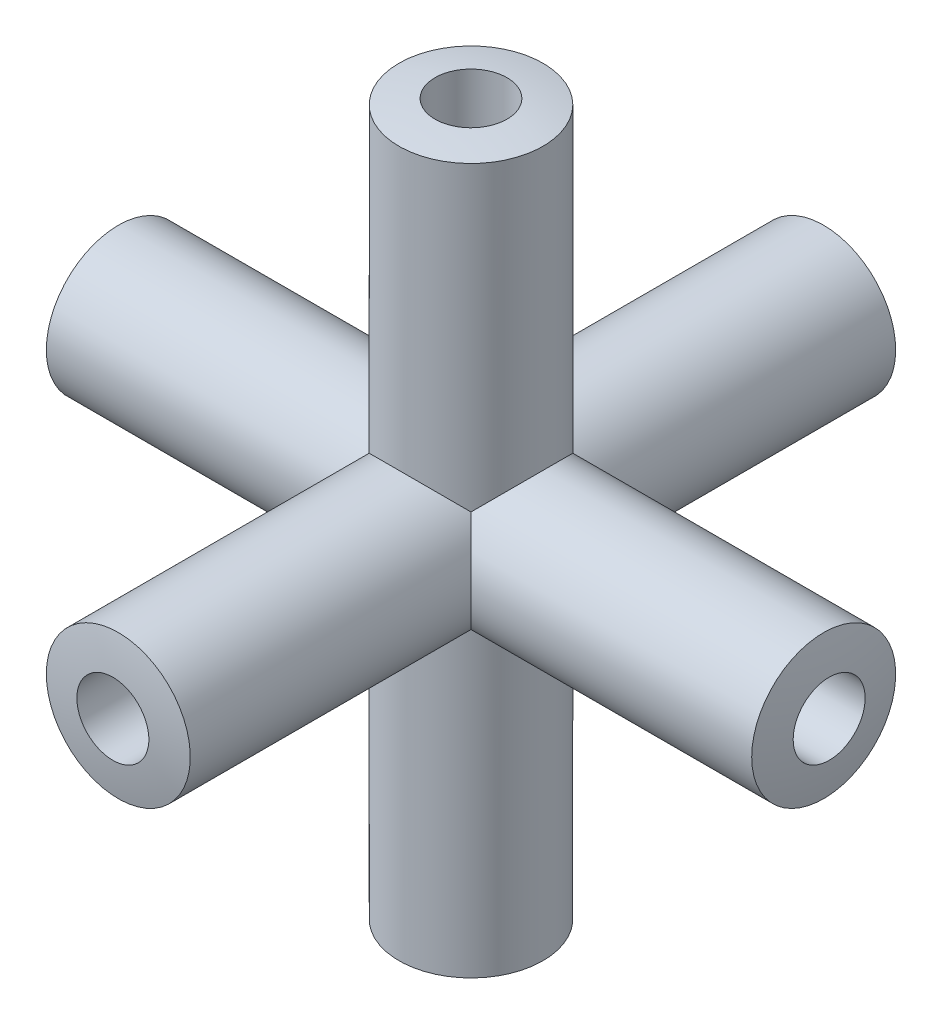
from build123d import *
from build123d.topology import SkipClean

# Parameters (mm, degrees)
SKETCH1_R                   = 10
SKETCH1_R_2                 = 5
BOSS_EXTRUDE1_DEPTH         = 50
SKETCH2_R                   = 10
SKETCH2_R_2                 = 5
BOSS_EXTRUDE2_DEPTH         = 50
SKETCH3_R                   = 10
SKETCH3_R_2                 = 5
BOSS_EXTRUDE3_DEPTH         = 50
SKETCH4_R                   = 5
CUT_EXTRUDE1_DEPTH          = 123.474487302
SKETCH5_R                   = 5
CUT_EXTRUDE2_DEPTH          = 123.474487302
SKETCH6_R                   = 5
CUT_EXTRUDE3_DEPTH          = 123.474487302
SKETCH8_W                   = 1
SKETCH8_H                   = 5
CIRPATTERN1_COUNT           = 2
CIRPATTERN2_COUNT           = 2
CIRPATTERN2_ANGLE           = 90
CIRPATTERN2_COPY_1_SKETCH_W = 1
CIRPATTERN2_COPY_1_SKETCH_H = 5
CIRPATTERN3_COPY_1_SKETCH_W = 1
CIRPATTERN3_COPY_1_SKETCH_H = 5
CIRPATTERN3_COPY_2_SKETCH_W = 1
CIRPATTERN3_COPY_2_SKETCH_H = 5
CIRPATTERN3_COPY_3_SKETCH_W = 1
CIRPATTERN3_COPY_3_SKETCH_H = 5
SCALE1_SCALE                = 0.75


with BuildPart() as part:
    # Sketch1 → Boss-Extrude1 (new, symmetric)
    with BuildSketch(Plane.XY):
        Circle(SKETCH1_R)
        Circle(SKETCH1_R_2, mode=Mode.SUBTRACT)
    extrude(amount=BOSS_EXTRUDE1_DEPTH, both=True)

    # Sketch2 → Boss-Extrude2 (add, symmetric)
    with BuildSketch(Plane(origin=(0, 0, 0), x_dir=(1, 0, 0), z_dir=(0, 1, 0))):
        Circle(SKETCH2_R)
        with Locations(Location((0, 0, 0), (0, 0, 90))):
            Circle(SKETCH2_R_2, mode=Mode.SUBTRACT)
    extrude(amount=BOSS_EXTRUDE2_DEPTH, both=True)

    # Sketch3 → Boss-Extrude3 (add, symmetric)
    with BuildSketch(Plane(origin=(0, 0, 0), x_dir=(0, 0, -1), z_dir=(1, 0, 0))):
        with Locations(Location((0, 0, 0), (0, 0, 225))):
            Circle(SKETCH3_R)
        with Locations(Location((0, 0, 0), (0, 0, 135.000006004))):
            Circle(SKETCH3_R_2, mode=Mode.SUBTRACT)
    extrude(amount=BOSS_EXTRUDE3_DEPTH, both=True)

    # Sketch4 → Cut-Extrude1 (cut, through all)
    with SkipClean():  # the faces are left unmerged after this step: merging them gives an invalid solid
        with BuildSketch(Plane(origin=(0, 50, 0), x_dir=(1, 0, 0), z_dir=(0, 1, 0))):
            with Locations(Location((0, 0, 0), (0, 0, 270))):
                Circle(SKETCH4_R)
        extrude(amount=-CUT_EXTRUDE1_DEPTH, mode=Mode.SUBTRACT)

    # Sketch5 → Cut-Extrude2 (cut, through all)
    with SkipClean():  # the faces are left unmerged after this step: merging them gives an invalid solid
        with BuildSketch(Plane.XY.offset(50)):
            Circle(SKETCH5_R)
        extrude(amount=-CUT_EXTRUDE2_DEPTH, mode=Mode.SUBTRACT)

    # Sketch6 → Cut-Extrude3 (cut, through all)
    with SkipClean():  # the faces are left unmerged after this step: merging them gives an invalid solid
        with BuildSketch(Plane(origin=(50, 0, 0), x_dir=(0, 0, -1), z_dir=(1, 0, 0))):
            with Locations(Location((0, 0, 0), (0, 0, 225))):
                Circle(SKETCH6_R)
        extrude(amount=-CUT_EXTRUDE3_DEPTH, mode=Mode.SUBTRACT)

    # Sketch7 → Cut-Revolve1 (revolve, cut)
    with SkipClean():  # the faces are left unmerged after this step: merging them gives an invalid solid
        with BuildSketch(Plane.XY):
            with BuildLine():
                Line((0, -55), (0, -50))
                ThreePointArc((0, -50), (-50, 0), (0, 50))
                Line((0, 50), (0, 55))
                ThreePointArc((0, 55), (-55, 0), (0, -55))
            make_face()
        revolve(axis=Axis((0, -50, 0), (0, 1, 0)), mode=Mode.SUBTRACT)

    # Sketch8 → Cut-Revolve2 (revolve, cut)
    with SkipClean():  # the faces are left unmerged after this step: merging them gives an invalid solid
        with BuildSketch(Plane.XY, mode=Mode.PRIVATE) as cut_revolve2_sk:
            with Locations((-5.5, 22.5)):
                Rectangle(SKETCH8_W, SKETCH8_H)
        cut_revolve2 = revolve(cut_revolve2_sk.sketch.rotate(Axis((0, 25, 0), (0, -1, 0)), 45), axis=Axis((0, 25, 0), (0, -1, 0)), mode=Mode.SUBTRACT)

    # CirPattern1: Cut-Revolve2 ×2 about axis
    with SkipClean():  # the faces are left unmerged after this step: merging them gives an invalid solid
        cirpattern1_axis = Axis((0, 0, 0), (0, 0, 1))
        for i in range(1, CIRPATTERN1_COUNT):
            add(cut_revolve2.rotate(cirpattern1_axis, i * 360 / CIRPATTERN1_COUNT), mode=Mode.SUBTRACT)

    # CirPattern2: Cut-Revolve2 ×2 about axis
    with SkipClean():  # the faces are left unmerged after this step: merging them gives an invalid solid
        cirpattern2_axis = Axis((0, 0, 0), (0, 0, 1))
        for i in range(1, CIRPATTERN2_COUNT):
            add(cut_revolve2.rotate(cirpattern2_axis, i * CIRPATTERN2_ANGLE / (CIRPATTERN2_COUNT - 1)), mode=Mode.SUBTRACT)

    # CirPattern2 copy 1 sketch → CirPattern2 copy 1 (revolve, cut)
    with BuildSketch(Plane(origin=(0, 0, 0), x_dir=(0, -1, 0), z_dir=(0, 0, 1))):
        with Locations((-5.5, 22.5)):
            Rectangle(CIRPATTERN2_COPY_1_SKETCH_W, CIRPATTERN2_COPY_1_SKETCH_H)
    revolve(axis=Axis((25, 0, 0), (-1, 0, 0)), mode=Mode.SUBTRACT)

    # CirPattern3 copy 1 sketch → CirPattern3 copy 1 (revolve, cut)
    with BuildSketch(Plane.YZ):
        with Locations((-5.5, 22.5)):
            Rectangle(CIRPATTERN3_COPY_1_SKETCH_W, CIRPATTERN3_COPY_1_SKETCH_H)
    revolve(axis=Axis((0, 0, 25), (0, 0, -1)), mode=Mode.SUBTRACT)

    # CirPattern3 copy 2 sketch → CirPattern3 copy 2 (revolve, cut)
    with BuildSketch(Plane(origin=(0, 0, 0), x_dir=(0, -1, 0), z_dir=(1, 0, 0))):
        with Locations((-5.5, 22.5)):
            Rectangle(CIRPATTERN3_COPY_2_SKETCH_W, CIRPATTERN3_COPY_2_SKETCH_H)
    revolve(axis=Axis((0, 0, -25), (0, 0, 1)), mode=Mode.SUBTRACT)

    # CirPattern3 copy 3 sketch → CirPattern3 copy 3 (revolve, cut)
    with SkipClean():  # the faces are left unmerged after this step: merging them gives an invalid solid
        with BuildSketch(Plane(origin=(0, 0, 0), x_dir=(0, 0, -1), z_dir=(1, 0, 0))):
            with Locations((-5.5, 22.5)):
                Rectangle(CIRPATTERN3_COPY_3_SKETCH_W, CIRPATTERN3_COPY_3_SKETCH_H)
        revolve(axis=Axis((0, 25, 0), (0, -1, 0)), mode=Mode.SUBTRACT)


with BuildPart() as part_1:
    # Scale1: scaled about (-3.0965e-05, -4.38e-06, -2.1391e-05)
    add(part.part.scale(SCALE1_SCALE).moved(Location((-7.741e-06, -1.095e-06, -5.348e-06))))


solid = part_1.part
